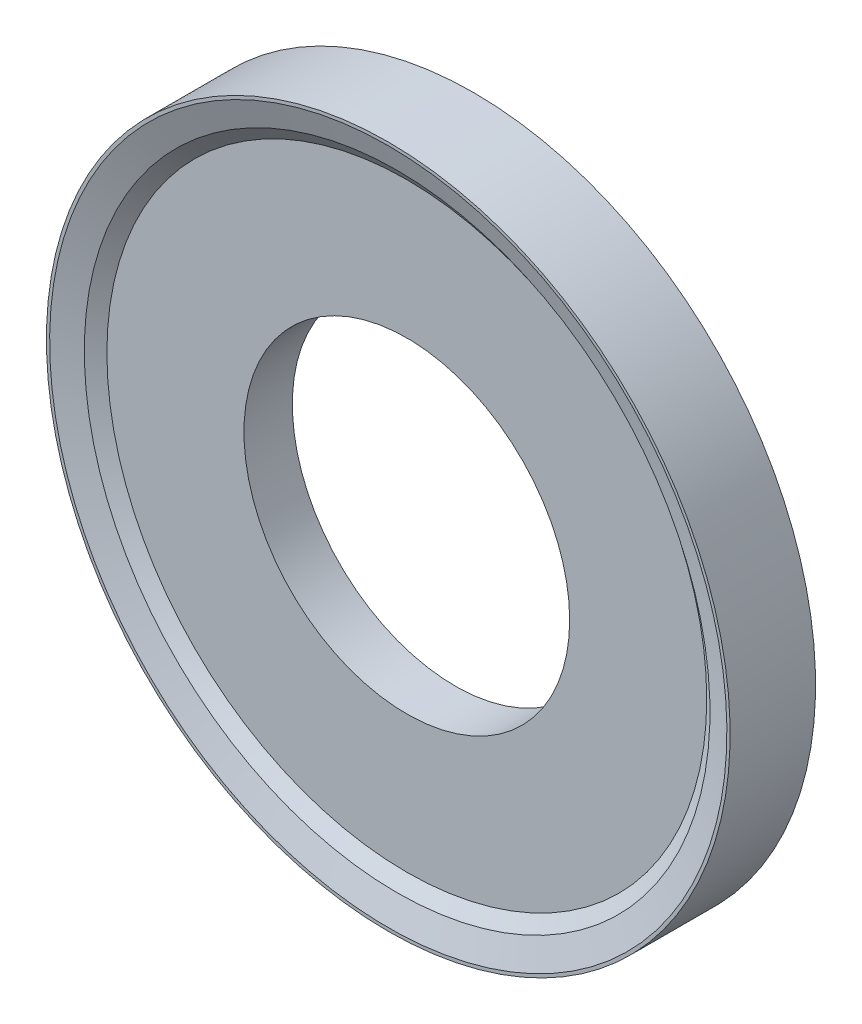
ISO-10303-21;
HEADER;
FILE_DESCRIPTION(('STEP AP214'),'2;1');
FILE_NAME('part.step','',(''),(''),'','','');
FILE_SCHEMA(('AUTOMOTIVE_DESIGN { 1 0 10303 214 1 1 1 1 }'));
ENDSEC;
DATA;
#1=APPLICATION_CONTEXT('core data for automotive mechanical design processes');
#2=APPLICATION_PROTOCOL_DEFINITION('international standard','automotive_design',2000,#1);
#3=PRODUCT_CONTEXT('',#1,'mechanical');
#4=PRODUCT('Part','Part','',(#3));
#5=PRODUCT_RELATED_PRODUCT_CATEGORY('part','',(#4));
#6=PRODUCT_DEFINITION_FORMATION('','',#4);
#7=PRODUCT_DEFINITION_CONTEXT('part definition',#1,'design');
#8=PRODUCT_DEFINITION('design','',#6,#7);
#9=PRODUCT_DEFINITION_SHAPE('','',#8);
#10=(LENGTH_UNIT() NAMED_UNIT(*) SI_UNIT(.MILLI.,.METRE.));
#11=(NAMED_UNIT(*) PLANE_ANGLE_UNIT() SI_UNIT($,.RADIAN.));
#12=(NAMED_UNIT(*) SI_UNIT($,.STERADIAN.) SOLID_ANGLE_UNIT());
#13=UNCERTAINTY_MEASURE_WITH_UNIT(LENGTH_MEASURE(1.E-05),#10,'distance_accuracy_value','');
#14=(GEOMETRIC_REPRESENTATION_CONTEXT(3) GLOBAL_UNCERTAINTY_ASSIGNED_CONTEXT((#13)) GLOBAL_UNIT_ASSIGNED_CONTEXT((#10,
#11,#12)) REPRESENTATION_CONTEXT('',''));
#15=CARTESIAN_POINT('',(0.,0.,0.));
#16=DIRECTION('',(0.,0.,1.));
#17=DIRECTION('',(1.,0.,0.));
#18=AXIS2_PLACEMENT_3D('',#15,#16,#17);
#19=CARTESIAN_POINT('',(9.3,0.,2.075));
#20=DIRECTION('',(0.,0.,1.));
#21=DIRECTION('',(0.,-1.,0.));
#22=AXIS2_PLACEMENT_3D('',#19,#20,#21);
#23=PLANE('',#22);
#24=CARTESIAN_POINT('',(0.,0.,2.075));
#25=DIRECTION('',(0.,0.,-1.));
#26=DIRECTION('',(0.,1.,0.));
#27=AXIS2_PLACEMENT_3D('',#24,#25,#26);
#28=CIRCLE('',#27,9.3);
#29=CARTESIAN_POINT('',(0.,9.3,2.075));
#30=VERTEX_POINT('',#29);
#31=EDGE_CURVE('E40',#30,#30,#28,.T.);
#32=ORIENTED_EDGE('',*,*,#31,.F.);
#33=EDGE_LOOP('',(#32));
#34=FACE_BOUND('',#33,.T.);
#35=CARTESIAN_POINT('',(0.,0.,2.075));
#36=DIRECTION('',(0.,0.,1.));
#37=DIRECTION('',(1.,0.,0.));
#38=AXIS2_PLACEMENT_3D('',#35,#36,#37);
#39=CIRCLE('',#38,5.05);
#40=CARTESIAN_POINT('',(5.05,0.,2.075));
#41=VERTEX_POINT('',#40);
#42=EDGE_CURVE('E44',#41,#41,#39,.T.);
#43=ORIENTED_EDGE('',*,*,#42,.F.);
#44=EDGE_LOOP('',(#43));
#45=FACE_BOUND('',#44,.T.);
#46=ADVANCED_FACE('F12',(#34,#45),#23,.T.);
#47=CARTESIAN_POINT('',(5.1,0.,0.575));
#48=DIRECTION('',(0.,0.,-1.));
#49=DIRECTION('',(0.,1.,0.));
#50=AXIS2_PLACEMENT_3D('',#47,#48,#49);
#51=PLANE('',#50);
#52=CARTESIAN_POINT('',(0.,0.,0.575));
#53=DIRECTION('',(0.,0.,-1.));
#54=DIRECTION('',(0.,1.,0.));
#55=AXIS2_PLACEMENT_3D('',#52,#53,#54);
#56=CIRCLE('',#55,9.3);
#57=CARTESIAN_POINT('',(0.,9.3,0.575));
#58=VERTEX_POINT('',#57);
#59=EDGE_CURVE('E8',#58,#58,#56,.T.);
#60=ORIENTED_EDGE('',*,*,#59,.T.);
#61=EDGE_LOOP('',(#60));
#62=FACE_BOUND('',#61,.T.);
#63=CARTESIAN_POINT('',(0.,0.,0.575));
#64=DIRECTION('',(0.,0.,1.));
#65=DIRECTION('',(1.,0.,0.));
#66=AXIS2_PLACEMENT_3D('',#63,#64,#65);
#67=CIRCLE('',#66,5.05);
#68=CARTESIAN_POINT('',(5.05,0.,0.575));
#69=VERTEX_POINT('',#68);
#70=EDGE_CURVE('E43',#69,#69,#67,.T.);
#71=ORIENTED_EDGE('',*,*,#70,.T.);
#72=EDGE_LOOP('',(#71));
#73=FACE_BOUND('',#72,.T.);
#74=ADVANCED_FACE('F50',(#62,#73),#51,.T.);
#75=CARTESIAN_POINT('',(0.,0.,0.575));
#76=DIRECTION('',(0.,0.,-1.));
#77=DIRECTION('',(0.,1.,0.));
#78=AXIS2_PLACEMENT_3D('',#75,#76,#77);
#79=CONICAL_SURFACE('',#78,9.3,0.927295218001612);
#80=CARTESIAN_POINT('',(0.,0.,0.275));
#81=DIRECTION('',(0.,0.,-1.));
#82=DIRECTION('',(0.,1.,0.));
#83=AXIS2_PLACEMENT_3D('',#80,#81,#82);
#84=CIRCLE('',#83,9.7);
#85=CARTESIAN_POINT('',(0.,9.7,0.275));
#86=VERTEX_POINT('',#85);
#87=EDGE_CURVE('E18',#86,#86,#84,.T.);
#88=ORIENTED_EDGE('',*,*,#87,.T.);
#89=EDGE_LOOP('',(#88));
#90=FACE_BOUND('',#89,.T.);
#91=ORIENTED_EDGE('',*,*,#59,.F.);
#92=EDGE_LOOP('',(#91));
#93=FACE_BOUND('',#92,.T.);
#94=ADVANCED_FACE('F65',(#90,#93),#79,.F.);
#95=CARTESIAN_POINT('',(0.,0.,0.275));
#96=DIRECTION('',(0.,0.,-1.));
#97=DIRECTION('',(0.,1.,0.));
#98=AXIS2_PLACEMENT_3D('',#95,#96,#97);
#99=CONICAL_SURFACE('',#98,9.7,1.23970025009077);
#100=CARTESIAN_POINT('',(0.,0.,0.));
#101=DIRECTION('',(0.,0.,-1.));
#102=DIRECTION('',(0.,1.,0.));
#103=AXIS2_PLACEMENT_3D('',#100,#101,#102);
#104=CIRCLE('',#103,10.5);
#105=CARTESIAN_POINT('',(0.,10.5,0.));
#106=VERTEX_POINT('',#105);
#107=EDGE_CURVE('E22',#106,#106,#104,.T.);
#108=ORIENTED_EDGE('',*,*,#107,.T.);
#109=EDGE_LOOP('',(#108));
#110=FACE_BOUND('',#109,.T.);
#111=ORIENTED_EDGE('',*,*,#87,.F.);
#112=EDGE_LOOP('',(#111));
#113=FACE_BOUND('',#112,.T.);
#114=ADVANCED_FACE('F94',(#110,#113),#99,.F.);
#115=CARTESIAN_POINT('',(10.5,0.,0.));
#116=DIRECTION('',(0.,0.,-1.));
#117=DIRECTION('',(0.,1.,0.));
#118=AXIS2_PLACEMENT_3D('',#115,#116,#117);
#119=PLANE('',#118);
#120=CARTESIAN_POINT('',(0.,0.,0.));
#121=DIRECTION('',(0.,0.,-1.));
#122=DIRECTION('',(0.,1.,0.));
#123=AXIS2_PLACEMENT_3D('',#120,#121,#122);
#124=CIRCLE('',#123,10.6);
#125=CARTESIAN_POINT('',(0.,10.6,0.));
#126=VERTEX_POINT('',#125);
#127=EDGE_CURVE('E26',#126,#126,#124,.T.);
#128=ORIENTED_EDGE('',*,*,#127,.T.);
#129=EDGE_LOOP('',(#128));
#130=FACE_BOUND('',#129,.T.);
#131=ORIENTED_EDGE('',*,*,#107,.F.);
#132=EDGE_LOOP('',(#131));
#133=FACE_BOUND('',#132,.T.);
#134=ADVANCED_FACE('F88',(#130,#133),#119,.T.);
#135=CARTESIAN_POINT('',(0.,0.,0.));
#136=DIRECTION('',(0.,0.,-1.));
#137=DIRECTION('',(0.,1.,0.));
#138=AXIS2_PLACEMENT_3D('',#135,#136,#137);
#139=CYLINDRICAL_SURFACE('',#138,10.6);
#140=CARTESIAN_POINT('',(0.,0.,2.65));
#141=DIRECTION('',(0.,0.,-1.));
#142=DIRECTION('',(0.,1.,0.));
#143=AXIS2_PLACEMENT_3D('',#140,#141,#142);
#144=CIRCLE('',#143,10.6);
#145=CARTESIAN_POINT('',(0.,10.6,2.65));
#146=VERTEX_POINT('',#145);
#147=EDGE_CURVE('E31',#146,#146,#144,.T.);
#148=ORIENTED_EDGE('',*,*,#147,.T.);
#149=EDGE_LOOP('',(#148));
#150=FACE_BOUND('',#149,.T.);
#151=ORIENTED_EDGE('',*,*,#127,.F.);
#152=EDGE_LOOP('',(#151));
#153=FACE_BOUND('',#152,.T.);
#154=ADVANCED_FACE('F82',(#150,#153),#139,.T.);
#155=CARTESIAN_POINT('',(10.6,0.,2.65));
#156=DIRECTION('',(0.,0.,1.));
#157=DIRECTION('',(0.,-1.,0.));
#158=AXIS2_PLACEMENT_3D('',#155,#156,#157);
#159=PLANE('',#158);
#160=CARTESIAN_POINT('',(0.,0.,2.65));
#161=DIRECTION('',(0.,0.,-1.));
#162=DIRECTION('',(0.,1.,0.));
#163=AXIS2_PLACEMENT_3D('',#160,#161,#162);
#164=CIRCLE('',#163,10.5);
#165=CARTESIAN_POINT('',(0.,10.5,2.65));
#166=VERTEX_POINT('',#165);
#167=EDGE_CURVE('E34',#166,#166,#164,.T.);
#168=ORIENTED_EDGE('',*,*,#167,.T.);
#169=EDGE_LOOP('',(#168));
#170=FACE_BOUND('',#169,.T.);
#171=ORIENTED_EDGE('',*,*,#147,.F.);
#172=EDGE_LOOP('',(#171));
#173=FACE_BOUND('',#172,.T.);
#174=ADVANCED_FACE('F76',(#170,#173),#159,.T.);
#175=CARTESIAN_POINT('',(0.,0.,2.65));
#176=DIRECTION('',(0.,0.,1.));
#177=DIRECTION('',(0.,-1.,0.));
#178=AXIS2_PLACEMENT_3D('',#175,#176,#177);
#179=CONICAL_SURFACE('',#178,10.5,1.23970025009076);
#180=CARTESIAN_POINT('',(0.,0.,2.375));
#181=DIRECTION('',(0.,0.,-1.));
#182=DIRECTION('',(0.,1.,0.));
#183=AXIS2_PLACEMENT_3D('',#180,#181,#182);
#184=CIRCLE('',#183,9.7);
#185=CARTESIAN_POINT('',(0.,9.7,2.375));
#186=VERTEX_POINT('',#185);
#187=EDGE_CURVE('E37',#186,#186,#184,.T.);
#188=ORIENTED_EDGE('',*,*,#187,.T.);
#189=EDGE_LOOP('',(#188));
#190=FACE_BOUND('',#189,.T.);
#191=ORIENTED_EDGE('',*,*,#167,.F.);
#192=EDGE_LOOP('',(#191));
#193=FACE_BOUND('',#192,.T.);
#194=ADVANCED_FACE('F70',(#190,#193),#179,.F.);
#195=CARTESIAN_POINT('',(0.,0.,2.375));
#196=DIRECTION('',(0.,0.,1.));
#197=DIRECTION('',(0.,-1.,0.));
#198=AXIS2_PLACEMENT_3D('',#195,#196,#197);
#199=CONICAL_SURFACE('',#198,9.7,0.927295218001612);
#200=ORIENTED_EDGE('',*,*,#31,.T.);
#201=EDGE_LOOP('',(#200));
#202=FACE_BOUND('',#201,.T.);
#203=ORIENTED_EDGE('',*,*,#187,.F.);
#204=EDGE_LOOP('',(#203));
#205=FACE_BOUND('',#204,.T.);
#206=ADVANCED_FACE('F55',(#202,#205),#199,.F.);
#207=CARTESIAN_POINT('',(0.,0.,0.575));
#208=DIRECTION('',(0.,0.,1.));
#209=DIRECTION('',(1.,0.,0.));
#210=AXIS2_PLACEMENT_3D('',#207,#208,#209);
#211=CYLINDRICAL_SURFACE('',#210,5.05);
#212=ORIENTED_EDGE('',*,*,#70,.F.);
#213=EDGE_LOOP('',(#212));
#214=FACE_BOUND('',#213,.T.);
#215=ORIENTED_EDGE('',*,*,#42,.T.);
#216=EDGE_LOOP('',(#215));
#217=FACE_BOUND('',#216,.T.);
#218=ADVANCED_FACE('F52',(#214,#217),#211,.F.);
#219=CLOSED_SHELL('',(#46,#74,#94,#114,#134,#154,#174,#194,#206,#218));
#220=MANIFOLD_SOLID_BREP('B1',#219);
#221=ADVANCED_BREP_SHAPE_REPRESENTATION('',(#18,#220),#14);
#222=SHAPE_DEFINITION_REPRESENTATION(#9,#221);
ENDSEC;
END-ISO-10303-21;
